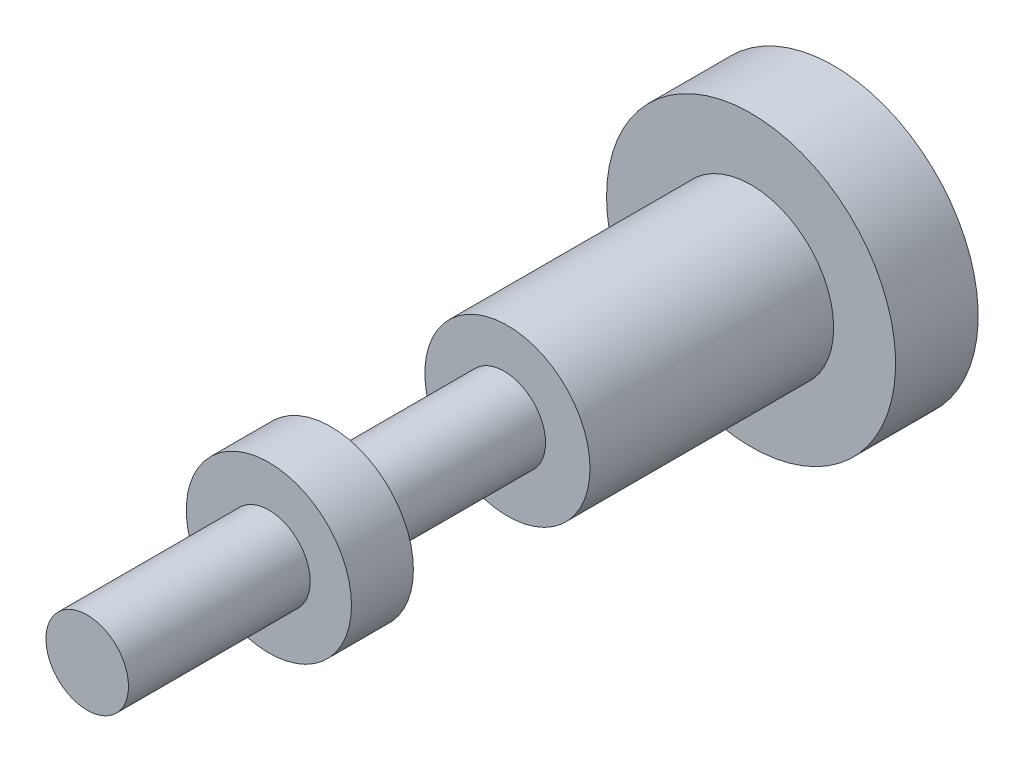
ISO-10303-21;
HEADER;
FILE_DESCRIPTION(('STEP AP214'),'2;1');
FILE_NAME('part.step','',(''),(''),'','','');
FILE_SCHEMA(('AUTOMOTIVE_DESIGN { 1 0 10303 214 1 1 1 1 }'));
ENDSEC;
DATA;
#1=APPLICATION_CONTEXT('core data for automotive mechanical design processes');
#2=APPLICATION_PROTOCOL_DEFINITION('international standard','automotive_design',2000,#1);
#3=PRODUCT_CONTEXT('',#1,'mechanical');
#4=PRODUCT('Part','Part','',(#3));
#5=PRODUCT_RELATED_PRODUCT_CATEGORY('part','',(#4));
#6=PRODUCT_DEFINITION_FORMATION('','',#4);
#7=PRODUCT_DEFINITION_CONTEXT('part definition',#1,'design');
#8=PRODUCT_DEFINITION('design','',#6,#7);
#9=PRODUCT_DEFINITION_SHAPE('','',#8);
#10=(LENGTH_UNIT() NAMED_UNIT(*) SI_UNIT(.MILLI.,.METRE.));
#11=(NAMED_UNIT(*) PLANE_ANGLE_UNIT() SI_UNIT($,.RADIAN.));
#12=(NAMED_UNIT(*) SI_UNIT($,.STERADIAN.) SOLID_ANGLE_UNIT());
#13=UNCERTAINTY_MEASURE_WITH_UNIT(LENGTH_MEASURE(1.E-05),#10,'distance_accuracy_value','');
#14=(GEOMETRIC_REPRESENTATION_CONTEXT(3) GLOBAL_UNCERTAINTY_ASSIGNED_CONTEXT((#13)) GLOBAL_UNIT_ASSIGNED_CONTEXT((#10,
#11,#12)) REPRESENTATION_CONTEXT('',''));
#15=CARTESIAN_POINT('',(0.,0.,0.));
#16=DIRECTION('',(0.,0.,1.));
#17=DIRECTION('',(1.,0.,0.));
#18=AXIS2_PLACEMENT_3D('',#15,#16,#17);
#19=CARTESIAN_POINT('',(-20.1832849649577,4.67630975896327,20.2));
#20=DIRECTION('',(0.,0.,1.));
#21=DIRECTION('',(1.,0.,0.));
#22=AXIS2_PLACEMENT_3D('',#19,#20,#21);
#23=CYLINDRICAL_SURFACE('',#22,4.);
#24=CARTESIAN_POINT('',(-20.1832849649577,4.67630975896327,20.2));
#25=DIRECTION('',(0.,0.,1.));
#26=DIRECTION('',(1.,0.,0.));
#27=AXIS2_PLACEMENT_3D('',#24,#25,#26);
#28=CIRCLE('',#27,4.);
#29=CARTESIAN_POINT('',(-16.1832849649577,4.67630975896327,20.2));
#30=VERTEX_POINT('',#29);
#31=EDGE_CURVE('E56',#30,#30,#28,.T.);
#32=ORIENTED_EDGE('',*,*,#31,.T.);
#33=EDGE_LOOP('',(#32));
#34=FACE_BOUND('',#33,.T.);
#35=CARTESIAN_POINT('',(-20.1832849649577,4.67630975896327,23.2));
#36=DIRECTION('',(0.,0.,1.));
#37=DIRECTION('',(1.,0.,0.));
#38=AXIS2_PLACEMENT_3D('',#35,#36,#37);
#39=CIRCLE('',#38,4.);
#40=CARTESIAN_POINT('',(-16.1832849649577,4.67630975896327,23.2));
#41=VERTEX_POINT('',#40);
#42=EDGE_CURVE('E62',#41,#41,#39,.T.);
#43=ORIENTED_EDGE('',*,*,#42,.F.);
#44=EDGE_LOOP('',(#43));
#45=FACE_BOUND('',#44,.T.);
#46=ADVANCED_FACE('F33',(#34,#45),#23,.T.);
#47=CARTESIAN_POINT('',(-20.1832849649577,4.79777777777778,11.8));
#48=DIRECTION('',(0.,0.,1.));
#49=DIRECTION('',(1.,0.,0.));
#50=AXIS2_PLACEMENT_3D('',#47,#48,#49);
#51=CYLINDRICAL_SURFACE('',#50,2.);
#52=CARTESIAN_POINT('',(-20.1832849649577,4.79777777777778,11.8));
#53=DIRECTION('',(0.,0.,1.));
#54=DIRECTION('',(1.,0.,0.));
#55=AXIS2_PLACEMENT_3D('',#52,#53,#54);
#56=CIRCLE('',#55,2.);
#57=CARTESIAN_POINT('',(-18.1832849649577,4.79777777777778,11.8));
#58=VERTEX_POINT('',#57);
#59=EDGE_CURVE('E53',#58,#58,#56,.T.);
#60=ORIENTED_EDGE('',*,*,#59,.T.);
#61=EDGE_LOOP('',(#60));
#62=FACE_BOUND('',#61,.T.);
#63=CARTESIAN_POINT('',(-20.1832849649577,4.79777777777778,20.2));
#64=DIRECTION('',(0.,0.,1.));
#65=DIRECTION('',(1.,0.,0.));
#66=AXIS2_PLACEMENT_3D('',#63,#64,#65);
#67=CIRCLE('',#66,2.);
#68=CARTESIAN_POINT('',(-18.1832849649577,4.79777777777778,20.2));
#69=VERTEX_POINT('',#68);
#70=EDGE_CURVE('E59',#69,#69,#67,.T.);
#71=ORIENTED_EDGE('',*,*,#70,.F.);
#72=EDGE_LOOP('',(#71));
#73=FACE_BOUND('',#72,.T.);
#74=ADVANCED_FACE('F83',(#62,#73),#51,.T.);
#75=CARTESIAN_POINT('',(-20.0281765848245,4.79777777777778,8.8));
#76=DIRECTION('',(0.,0.,1.));
#77=DIRECTION('',(1.,0.,0.));
#78=AXIS2_PLACEMENT_3D('',#75,#76,#77);
#79=CYLINDRICAL_SURFACE('',#78,4.);
#80=CARTESIAN_POINT('',(-20.0281765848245,4.79777777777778,11.8));
#81=DIRECTION('',(0.,0.,1.));
#82=DIRECTION('',(1.,0.,0.));
#83=AXIS2_PLACEMENT_3D('',#80,#81,#82);
#84=CIRCLE('',#83,4.);
#85=CARTESIAN_POINT('',(-16.0281765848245,4.79777777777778,11.8));
#86=VERTEX_POINT('',#85);
#87=EDGE_CURVE('E49',#86,#86,#84,.T.);
#88=ORIENTED_EDGE('',*,*,#87,.F.);
#89=EDGE_LOOP('',(#88));
#90=FACE_BOUND('',#89,.T.);
#91=CARTESIAN_POINT('',(-20.0281765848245,4.79777777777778,0.));
#92=DIRECTION('',(0.,0.,-1.));
#93=DIRECTION('',(-1.,0.,0.));
#94=AXIS2_PLACEMENT_3D('',#91,#92,#93);
#95=CIRCLE('',#94,4.);
#96=CARTESIAN_POINT('',(-24.0281765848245,4.79777777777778,0.));
#97=VERTEX_POINT('',#96);
#98=EDGE_CURVE('E10',#97,#97,#95,.F.);
#99=ORIENTED_EDGE('',*,*,#98,.T.);
#100=EDGE_LOOP('',(#99));
#101=FACE_BOUND('',#100,.T.);
#102=ADVANCED_FACE('F89',(#90,#101),#79,.T.);
#103=CARTESIAN_POINT('',(-20.0281765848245,4.79777777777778,11.8));
#104=DIRECTION('',(0.,0.,1.));
#105=DIRECTION('',(1.,0.,0.));
#106=AXIS2_PLACEMENT_3D('',#103,#104,#105);
#107=PLANE('',#106);
#108=ORIENTED_EDGE('',*,*,#59,.F.);
#109=EDGE_LOOP('',(#108));
#110=FACE_BOUND('',#109,.T.);
#111=ORIENTED_EDGE('',*,*,#87,.T.);
#112=EDGE_LOOP('',(#111));
#113=FACE_BOUND('',#112,.T.);
#114=ADVANCED_FACE('F94',(#110,#113),#107,.T.);
#115=CARTESIAN_POINT('',(-20.1832849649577,4.67630975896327,20.2));
#116=DIRECTION('',(0.,0.,1.));
#117=DIRECTION('',(1.,0.,0.));
#118=AXIS2_PLACEMENT_3D('',#115,#116,#117);
#119=PLANE('',#118);
#120=ORIENTED_EDGE('',*,*,#70,.T.);
#121=EDGE_LOOP('',(#120));
#122=FACE_BOUND('',#121,.T.);
#123=ORIENTED_EDGE('',*,*,#31,.F.);
#124=EDGE_LOOP('',(#123));
#125=FACE_BOUND('',#124,.T.);
#126=ADVANCED_FACE('F78',(#122,#125),#119,.F.);
#127=CARTESIAN_POINT('',(-20.1832849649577,4.67630975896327,23.2));
#128=DIRECTION('',(0.,0.,1.));
#129=DIRECTION('',(1.,0.,0.));
#130=AXIS2_PLACEMENT_3D('',#127,#128,#129);
#131=PLANE('',#130);
#132=CARTESIAN_POINT('',(-20.1832849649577,4.67630975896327,23.2));
#133=DIRECTION('',(0.,0.,1.));
#134=DIRECTION('',(1.,0.,0.));
#135=AXIS2_PLACEMENT_3D('',#132,#133,#134);
#136=CIRCLE('',#135,2.);
#137=CARTESIAN_POINT('',(-18.1832849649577,4.67630975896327,23.2));
#138=VERTEX_POINT('',#137);
#139=EDGE_CURVE('E65',#138,#138,#136,.T.);
#140=ORIENTED_EDGE('',*,*,#139,.F.);
#141=EDGE_LOOP('',(#140));
#142=FACE_BOUND('',#141,.T.);
#143=ORIENTED_EDGE('',*,*,#42,.T.);
#144=EDGE_LOOP('',(#143));
#145=FACE_BOUND('',#144,.T.);
#146=ADVANCED_FACE('F75',(#142,#145),#131,.T.);
#147=CARTESIAN_POINT('',(-20.1832849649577,4.67630975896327,23.2));
#148=DIRECTION('',(0.,0.,1.));
#149=DIRECTION('',(1.,0.,0.));
#150=AXIS2_PLACEMENT_3D('',#147,#148,#149);
#151=CYLINDRICAL_SURFACE('',#150,2.);
#152=ORIENTED_EDGE('',*,*,#139,.T.);
#153=EDGE_LOOP('',(#152));
#154=FACE_BOUND('',#153,.T.);
#155=CARTESIAN_POINT('',(-20.1832849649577,4.67630975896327,32.));
#156=DIRECTION('',(0.,0.,1.));
#157=DIRECTION('',(1.,0.,0.));
#158=AXIS2_PLACEMENT_3D('',#155,#156,#157);
#159=CIRCLE('',#158,2.);
#160=CARTESIAN_POINT('',(-18.1832849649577,4.67630975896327,32.));
#161=VERTEX_POINT('',#160);
#162=EDGE_CURVE('E66',#161,#161,#159,.T.);
#163=ORIENTED_EDGE('',*,*,#162,.F.);
#164=EDGE_LOOP('',(#163));
#165=FACE_BOUND('',#164,.T.);
#166=ADVANCED_FACE('F72',(#154,#165),#151,.T.);
#167=CARTESIAN_POINT('',(-20.0281765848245,4.79777777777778,32.));
#168=DIRECTION('',(0.,0.,1.));
#169=DIRECTION('',(1.,0.,0.));
#170=AXIS2_PLACEMENT_3D('',#167,#168,#169);
#171=PLANE('',#170);
#172=ORIENTED_EDGE('',*,*,#162,.T.);
#173=EDGE_LOOP('',(#172));
#174=FACE_BOUND('',#173,.T.);
#175=ADVANCED_FACE('F35',(#174),#171,.T.);
#176=CARTESIAN_POINT('',(-20.0281765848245,4.79777777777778,-4.));
#177=DIRECTION('',(0.,0.,-1.));
#178=DIRECTION('',(-1.,0.,0.));
#179=AXIS2_PLACEMENT_3D('',#176,#177,#178);
#180=PLANE('',#179);
#181=CARTESIAN_POINT('',(-20.0281765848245,4.79777777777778,-4.));
#182=DIRECTION('',(0.,0.,-1.));
#183=DIRECTION('',(-1.,0.,0.));
#184=AXIS2_PLACEMENT_3D('',#181,#182,#183);
#185=CIRCLE('',#184,7.);
#186=CARTESIAN_POINT('',(-27.0281765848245,4.79777777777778,-4.));
#187=VERTEX_POINT('',#186);
#188=EDGE_CURVE('E40',#187,#187,#185,.T.);
#189=ORIENTED_EDGE('',*,*,#188,.T.);
#190=EDGE_LOOP('',(#189));
#191=FACE_BOUND('',#190,.T.);
#192=ADVANCED_FACE('F101',(#191),#180,.T.);
#193=CARTESIAN_POINT('',(-20.0281765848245,4.79777777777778,-4.));
#194=DIRECTION('',(0.,0.,1.));
#195=DIRECTION('',(1.,0.,0.));
#196=AXIS2_PLACEMENT_3D('',#193,#194,#195);
#197=CYLINDRICAL_SURFACE('',#196,7.);
#198=ORIENTED_EDGE('',*,*,#188,.F.);
#199=EDGE_LOOP('',(#198));
#200=FACE_BOUND('',#199,.T.);
#201=CARTESIAN_POINT('',(-20.0281765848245,4.79777777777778,0.));
#202=DIRECTION('',(0.,0.,-1.));
#203=DIRECTION('',(-1.,0.,0.));
#204=AXIS2_PLACEMENT_3D('',#201,#202,#203);
#205=CIRCLE('',#204,7.);
#206=CARTESIAN_POINT('',(-27.0281765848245,4.79777777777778,0.));
#207=VERTEX_POINT('',#206);
#208=EDGE_CURVE('E44',#207,#207,#205,.T.);
#209=ORIENTED_EDGE('',*,*,#208,.T.);
#210=EDGE_LOOP('',(#209));
#211=FACE_BOUND('',#210,.T.);
#212=ADVANCED_FACE('F104',(#200,#211),#197,.T.);
#213=CARTESIAN_POINT('',(-20.0281765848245,4.79777777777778,0.));
#214=DIRECTION('',(0.,0.,-1.));
#215=DIRECTION('',(-1.,0.,0.));
#216=AXIS2_PLACEMENT_3D('',#213,#214,#215);
#217=PLANE('',#216);
#218=ORIENTED_EDGE('',*,*,#208,.F.);
#219=EDGE_LOOP('',(#218));
#220=FACE_BOUND('',#219,.T.);
#221=ORIENTED_EDGE('',*,*,#98,.F.);
#222=EDGE_LOOP('',(#221));
#223=FACE_BOUND('',#222,.T.);
#224=ADVANCED_FACE('F105',(#220,#223),#217,.F.);
#225=CLOSED_SHELL('',(#46,#74,#102,#114,#126,#146,#166,#175,#192,#212,#224));
#226=MANIFOLD_SOLID_BREP('B2',#225);
#227=ADVANCED_BREP_SHAPE_REPRESENTATION('',(#18,#226),#14);
#228=SHAPE_DEFINITION_REPRESENTATION(#9,#227);
ENDSEC;
END-ISO-10303-21;
